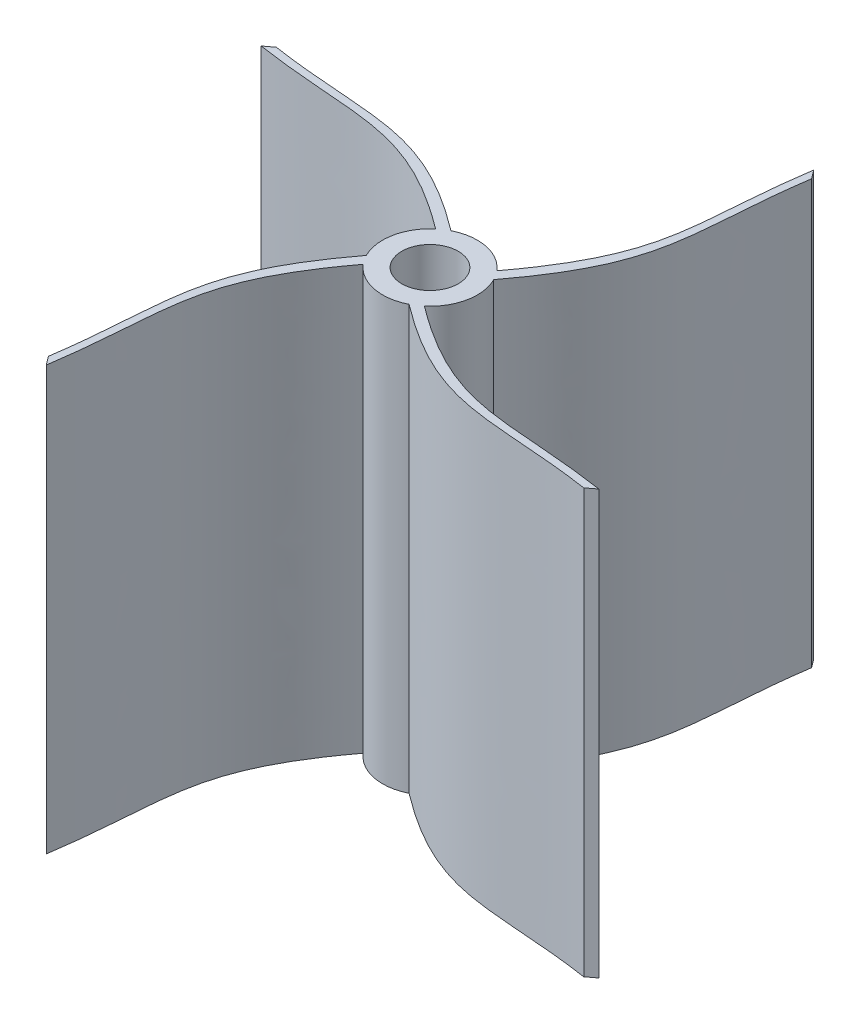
ISO-10303-21;
HEADER;
FILE_DESCRIPTION(('STEP AP214'),'2;1');
FILE_NAME('part.step','',(''),(''),'','','');
FILE_SCHEMA(('AUTOMOTIVE_DESIGN { 1 0 10303 214 1 1 1 1 }'));
ENDSEC;
DATA;
#1=APPLICATION_CONTEXT('core data for automotive mechanical design processes');
#2=APPLICATION_PROTOCOL_DEFINITION('international standard','automotive_design',2000,#1);
#3=PRODUCT_CONTEXT('',#1,'mechanical');
#4=PRODUCT('Part','Part','',(#3));
#5=PRODUCT_RELATED_PRODUCT_CATEGORY('part','',(#4));
#6=PRODUCT_DEFINITION_FORMATION('','',#4);
#7=PRODUCT_DEFINITION_CONTEXT('part definition',#1,'design');
#8=PRODUCT_DEFINITION('design','',#6,#7);
#9=PRODUCT_DEFINITION_SHAPE('','',#8);
#10=(LENGTH_UNIT() NAMED_UNIT(*) SI_UNIT(.MILLI.,.METRE.));
#11=(NAMED_UNIT(*) PLANE_ANGLE_UNIT() SI_UNIT($,.RADIAN.));
#12=(NAMED_UNIT(*) SI_UNIT($,.STERADIAN.) SOLID_ANGLE_UNIT());
#13=UNCERTAINTY_MEASURE_WITH_UNIT(LENGTH_MEASURE(1.E-05),#10,'distance_accuracy_value','');
#14=(GEOMETRIC_REPRESENTATION_CONTEXT(3) GLOBAL_UNCERTAINTY_ASSIGNED_CONTEXT((#13)) GLOBAL_UNIT_ASSIGNED_CONTEXT((#10,
#11,#12)) REPRESENTATION_CONTEXT('',''));
#15=CARTESIAN_POINT('',(0.,0.,0.));
#16=DIRECTION('',(0.,0.,1.));
#17=DIRECTION('',(1.,0.,0.));
#18=AXIS2_PLACEMENT_3D('',#15,#16,#17);
#19=CARTESIAN_POINT('',(-174.026951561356,300.,-50.4298145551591));
#20=CARTESIAN_POINT('',(-97.2351471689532,300.,-38.7856041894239));
#21=CARTESIAN_POINT('',(-71.1604524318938,300.,-53.3874332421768));
#22=CARTESIAN_POINT('',(0.,300.,0.));
#23=B_SPLINE_CURVE_WITH_KNOTS('',3,(#19,#20,#21,#22),.UNSPECIFIED.,.F.,.F.,(4,4),(0.,1.),.UNSPECIFIED.);
#24=DIRECTION('',(0.,-1.,0.));
#25=VECTOR('',#24,1.);
#26=SURFACE_OF_LINEAR_EXTRUSION('',#23,#25);
#27=CARTESIAN_POINT('',(-174.026951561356,0.,-50.4298145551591));
#28=CARTESIAN_POINT('',(-97.2351471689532,0.,-38.7856041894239));
#29=CARTESIAN_POINT('',(-71.1604524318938,0.,-53.3874332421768));
#30=CARTESIAN_POINT('',(0.,0.,0.));
#31=B_SPLINE_CURVE_WITH_KNOTS('',3,(#27,#28,#29,#30),.UNSPECIFIED.,.F.,.F.,(4,4),(0.,1.),.UNSPECIFIED.);
#32=CARTESIAN_POINT('',(-174.026951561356,0.,-50.4298145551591));
#33=VERTEX_POINT('',#32);
#34=CARTESIAN_POINT('',(0.,0.,0.));
#35=VERTEX_POINT('',#34);
#36=EDGE_CURVE('E301',#33,#35,#31,.T.);
#37=ORIENTED_EDGE('',*,*,#36,.T.);
#38=DIRECTION('',(0.,-1.,0.));
#39=VECTOR('',#38,1.);
#40=CARTESIAN_POINT('',(0.,300.,0.));
#41=LINE('',#40,#39);
#42=CARTESIAN_POINT('',(0.,300.,0.));
#43=VERTEX_POINT('',#42);
#44=EDGE_CURVE('E11',#43,#35,#41,.T.);
#45=ORIENTED_EDGE('',*,*,#44,.F.);
#46=CARTESIAN_POINT('',(-174.026951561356,300.,-50.4298145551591));
#47=VERTEX_POINT('',#46);
#48=EDGE_CURVE('E369',#47,#43,#23,.T.);
#49=ORIENTED_EDGE('',*,*,#48,.F.);
#50=DIRECTION('',(0.,-1.,0.));
#51=VECTOR('',#50,1.);
#52=CARTESIAN_POINT('',(-174.026951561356,300.,-50.4298145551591));
#53=LINE('',#52,#51);
#54=EDGE_CURVE('E174',#47,#33,#53,.T.);
#55=ORIENTED_EDGE('',*,*,#54,.T.);
#56=EDGE_LOOP('',(#37,#45,#49,#55));
#57=FACE_BOUND('',#56,.T.);
#58=ADVANCED_FACE('F33',(#57),#26,.F.);
#59=CARTESIAN_POINT('',(21.7032315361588,300.,25.6602335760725));
#60=DIRECTION('',(0.,-1.,0.));
#61=DIRECTION('',(0.,0.,-1.));
#62=AXIS2_PLACEMENT_3D('',#59,#60,#61);
#63=CYLINDRICAL_SURFACE('',#62,33.6077051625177);
#64=CARTESIAN_POINT('',(21.7032315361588,0.,25.6602335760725));
#65=DIRECTION('',(0.,1.,0.));
#66=DIRECTION('',(0.,0.,1.));
#67=AXIS2_PLACEMENT_3D('',#64,#65,#66);
#68=CIRCLE('',#67,33.6077051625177);
#69=CARTESIAN_POINT('',(-8.29676846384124,0.,40.808759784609));
#70=VERTEX_POINT('',#69);
#71=EDGE_CURVE('E292',#35,#70,#68,.T.);
#72=ORIENTED_EDGE('',*,*,#71,.T.);
#73=DIRECTION('',(0.,-1.,0.));
#74=VECTOR('',#73,1.);
#75=CARTESIAN_POINT('',(-8.29676846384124,300.,40.808759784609));
#76=LINE('',#75,#74);
#77=CARTESIAN_POINT('',(-8.29676846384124,300.,40.808759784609));
#78=VERTEX_POINT('',#77);
#79=EDGE_CURVE('E42',#78,#70,#76,.T.);
#80=ORIENTED_EDGE('',*,*,#79,.F.);
#81=CARTESIAN_POINT('',(21.7032315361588,300.,25.6602335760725));
#82=DIRECTION('',(0.,1.,0.));
#83=DIRECTION('',(0.,0.,1.));
#84=AXIS2_PLACEMENT_3D('',#81,#82,#83);
#85=CIRCLE('',#84,33.6077051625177);
#86=EDGE_CURVE('E117',#43,#78,#85,.T.);
#87=ORIENTED_EDGE('',*,*,#86,.F.);
#88=ORIENTED_EDGE('',*,*,#44,.T.);
#89=EDGE_LOOP('',(#72,#80,#87,#88));
#90=FACE_BOUND('',#89,.T.);
#91=ADVANCED_FACE('F285',(#90),#63,.T.);
#92=CARTESIAN_POINT('',(-8.29676846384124,300.,40.808759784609));
#93=CARTESIAN_POINT('',(-62.1358647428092,300.,112.049101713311));
#94=CARTESIAN_POINT('',(-47.5340356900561,300.,138.123796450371));
#95=CARTESIAN_POINT('',(-59.0069013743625,300.,215.304892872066));
#96=B_SPLINE_CURVE_WITH_KNOTS('',3,(#92,#93,#94,#95),.UNSPECIFIED.,.F.,.F.,(4,4),(0.,1.),.UNSPECIFIED.);
#97=DIRECTION('',(0.,-1.,0.));
#98=VECTOR('',#97,1.);
#99=SURFACE_OF_LINEAR_EXTRUSION('',#96,#98);
#100=CARTESIAN_POINT('',(-8.29676846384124,0.,40.808759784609));
#101=CARTESIAN_POINT('',(-62.1358647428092,0.,112.049101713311));
#102=CARTESIAN_POINT('',(-47.5340356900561,0.,138.123796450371));
#103=CARTESIAN_POINT('',(-59.0069013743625,0.,215.304892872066));
#104=B_SPLINE_CURVE_WITH_KNOTS('',3,(#100,#101,#102,#103),.UNSPECIFIED.,.F.,.F.,(4,4),(0.,1.),.UNSPECIFIED.);
#105=CARTESIAN_POINT('',(-59.0069013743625,0.,215.304892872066));
#106=VERTEX_POINT('',#105);
#107=EDGE_CURVE('E300',#70,#106,#104,.T.);
#108=ORIENTED_EDGE('',*,*,#107,.T.);
#109=DIRECTION('',(0.,-1.,0.));
#110=VECTOR('',#109,1.);
#111=CARTESIAN_POINT('',(-59.0069013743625,300.,215.304892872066));
#112=LINE('',#111,#110);
#113=CARTESIAN_POINT('',(-59.0069013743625,300.,215.304892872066));
#114=VERTEX_POINT('',#113);
#115=EDGE_CURVE('E305',#114,#106,#112,.T.);
#116=ORIENTED_EDGE('',*,*,#115,.F.);
#117=EDGE_CURVE('E275',#78,#114,#96,.T.);
#118=ORIENTED_EDGE('',*,*,#117,.F.);
#119=ORIENTED_EDGE('',*,*,#79,.T.);
#120=EDGE_LOOP('',(#108,#116,#118,#119));
#121=FACE_BOUND('',#120,.T.);
#122=ADVANCED_FACE('F283',(#121),#99,.F.);
#123=CARTESIAN_POINT('',(-59.0069013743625,300.,215.304892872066));
#124=DIRECTION('',(0.796471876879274,0.,-0.604675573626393));
#125=DIRECTION('',(-0.604675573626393,0.,-0.796471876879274));
#126=AXIS2_PLACEMENT_3D('',#123,#124,#125);
#127=PLANE('',#126);
#128=DIRECTION('',(0.604675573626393,0.,0.796471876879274));
#129=VECTOR('',#128,1.);
#130=CARTESIAN_POINT('',(-59.0069013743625,0.,215.304892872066));
#131=LINE('',#130,#129);
#132=CARTESIAN_POINT('',(-54.3868165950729,0.,221.390416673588));
#133=VERTEX_POINT('',#132);
#134=EDGE_CURVE('E309',#106,#133,#131,.T.);
#135=ORIENTED_EDGE('',*,*,#134,.T.);
#136=DIRECTION('',(0.,-1.,0.));
#137=VECTOR('',#136,1.);
#138=CARTESIAN_POINT('',(-54.3868165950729,300.,221.390416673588));
#139=LINE('',#138,#137);
#140=CARTESIAN_POINT('',(-54.3868165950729,300.,221.390416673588));
#141=VERTEX_POINT('',#140);
#142=EDGE_CURVE('E397',#141,#133,#139,.T.);
#143=ORIENTED_EDGE('',*,*,#142,.F.);
#144=DIRECTION('',(0.604675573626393,0.,0.796471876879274));
#145=VECTOR('',#144,1.);
#146=CARTESIAN_POINT('',(-59.0069013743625,300.,215.304892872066));
#147=LINE('',#146,#145);
#148=EDGE_CURVE('E270',#114,#141,#147,.T.);
#149=ORIENTED_EDGE('',*,*,#148,.F.);
#150=ORIENTED_EDGE('',*,*,#115,.T.);
#151=EDGE_LOOP('',(#135,#143,#149,#150));
#152=FACE_BOUND('',#151,.T.);
#153=ADVANCED_FACE('F262',(#152),#127,.F.);
#154=CARTESIAN_POINT('',(-54.3868165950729,300.,221.390416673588));
#155=CARTESIAN_POINT('',(-42.7426062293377,300.,144.598612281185));
#156=CARTESIAN_POINT('',(-57.3444352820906,300.,118.523917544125));
#157=CARTESIAN_POINT('',(-3.95700203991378,300.,47.3634651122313));
#158=B_SPLINE_CURVE_WITH_KNOTS('',3,(#154,#155,#156,#157),.UNSPECIFIED.,.F.,.F.,(4,4),(0.,1.),.UNSPECIFIED.);
#159=DIRECTION('',(0.,-1.,0.));
#160=VECTOR('',#159,1.);
#161=SURFACE_OF_LINEAR_EXTRUSION('',#158,#160);
#162=CARTESIAN_POINT('',(-54.3868165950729,0.,221.390416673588));
#163=CARTESIAN_POINT('',(-42.7426062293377,0.,144.598612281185));
#164=CARTESIAN_POINT('',(-57.3444352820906,0.,118.523917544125));
#165=CARTESIAN_POINT('',(-3.95700203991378,0.,47.3634651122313));
#166=B_SPLINE_CURVE_WITH_KNOTS('',3,(#162,#163,#164,#165),.UNSPECIFIED.,.F.,.F.,(4,4),(0.,1.),.UNSPECIFIED.);
#167=CARTESIAN_POINT('',(-3.95700203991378,0.,47.3634651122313));
#168=VERTEX_POINT('',#167);
#169=EDGE_CURVE('E311',#133,#168,#166,.T.);
#170=ORIENTED_EDGE('',*,*,#169,.T.);
#171=DIRECTION('',(0.,-1.,0.));
#172=VECTOR('',#171,1.);
#173=CARTESIAN_POINT('',(-3.95700203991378,300.,47.3634651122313));
#174=LINE('',#173,#172);
#175=CARTESIAN_POINT('',(-3.95700203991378,300.,47.3634651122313));
#176=VERTEX_POINT('',#175);
#177=EDGE_CURVE('E394',#176,#168,#174,.T.);
#178=ORIENTED_EDGE('',*,*,#177,.F.);
#179=EDGE_CURVE('E265',#141,#176,#158,.T.);
#180=ORIENTED_EDGE('',*,*,#179,.F.);
#181=ORIENTED_EDGE('',*,*,#142,.T.);
#182=EDGE_LOOP('',(#170,#178,#180,#181));
#183=FACE_BOUND('',#182,.T.);
#184=ADVANCED_FACE('F258',(#183),#161,.F.);
#185=CARTESIAN_POINT('',(21.7032315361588,300.,25.6602335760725));
#186=DIRECTION('',(0.,-1.,0.));
#187=DIRECTION('',(0.,0.,-1.));
#188=AXIS2_PLACEMENT_3D('',#185,#186,#187);
#189=CYLINDRICAL_SURFACE('',#188,33.6077051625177);
#190=CARTESIAN_POINT('',(21.7032315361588,0.,25.6602335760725));
#191=DIRECTION('',(0.,1.,0.));
#192=DIRECTION('',(0.,0.,1.));
#193=AXIS2_PLACEMENT_3D('',#190,#191,#192);
#194=CIRCLE('',#193,33.6077051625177);
#195=CARTESIAN_POINT('',(36.8517577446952,0.,55.6602335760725));
#196=VERTEX_POINT('',#195);
#197=EDGE_CURVE('E322',#168,#196,#194,.T.);
#198=ORIENTED_EDGE('',*,*,#197,.T.);
#199=DIRECTION('',(0.,-1.,0.));
#200=VECTOR('',#199,1.);
#201=CARTESIAN_POINT('',(36.8517577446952,300.,55.6602335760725));
#202=LINE('',#201,#200);
#203=CARTESIAN_POINT('',(36.8517577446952,300.,55.6602335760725));
#204=VERTEX_POINT('',#203);
#205=EDGE_CURVE('E391',#204,#196,#202,.T.);
#206=ORIENTED_EDGE('',*,*,#205,.F.);
#207=CARTESIAN_POINT('',(21.7032315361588,300.,25.6602335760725));
#208=DIRECTION('',(0.,1.,0.));
#209=DIRECTION('',(0.,0.,1.));
#210=AXIS2_PLACEMENT_3D('',#207,#208,#209);
#211=CIRCLE('',#210,33.6077051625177);
#212=EDGE_CURVE('E246',#176,#204,#211,.T.);
#213=ORIENTED_EDGE('',*,*,#212,.F.);
#214=ORIENTED_EDGE('',*,*,#177,.T.);
#215=EDGE_LOOP('',(#198,#206,#213,#214));
#216=FACE_BOUND('',#215,.T.);
#217=ADVANCED_FACE('F254',(#216),#189,.T.);
#218=CARTESIAN_POINT('',(36.8517577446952,300.,55.6602335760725));
#219=CARTESIAN_POINT('',(108.092099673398,300.,109.499329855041));
#220=CARTESIAN_POINT('',(134.166794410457,300.,94.8975008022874));
#221=CARTESIAN_POINT('',(211.347890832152,300.,106.370366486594));
#222=B_SPLINE_CURVE_WITH_KNOTS('',3,(#218,#219,#220,#221),.UNSPECIFIED.,.F.,.F.,(4,4),(0.,1.),.UNSPECIFIED.);
#223=DIRECTION('',(0.,-1.,0.));
#224=VECTOR('',#223,1.);
#225=SURFACE_OF_LINEAR_EXTRUSION('',#222,#224);
#226=CARTESIAN_POINT('',(36.8517577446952,0.,55.6602335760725));
#227=CARTESIAN_POINT('',(108.092099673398,0.,109.499329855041));
#228=CARTESIAN_POINT('',(134.166794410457,0.,94.8975008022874));
#229=CARTESIAN_POINT('',(211.347890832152,0.,106.370366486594));
#230=B_SPLINE_CURVE_WITH_KNOTS('',3,(#226,#227,#228,#229),.UNSPECIFIED.,.F.,.F.,(4,4),(0.,1.),.UNSPECIFIED.);
#231=CARTESIAN_POINT('',(211.347890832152,0.,106.370366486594));
#232=VERTEX_POINT('',#231);
#233=EDGE_CURVE('E327',#196,#232,#230,.T.);
#234=ORIENTED_EDGE('',*,*,#233,.T.);
#235=DIRECTION('',(0.,-1.,0.));
#236=VECTOR('',#235,1.);
#237=CARTESIAN_POINT('',(211.347890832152,300.,106.370366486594));
#238=LINE('',#237,#236);
#239=CARTESIAN_POINT('',(211.347890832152,300.,106.370366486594));
#240=VERTEX_POINT('',#239);
#241=EDGE_CURVE('E388',#240,#232,#238,.T.);
#242=ORIENTED_EDGE('',*,*,#241,.F.);
#243=EDGE_CURVE('E241',#204,#240,#222,.T.);
#244=ORIENTED_EDGE('',*,*,#243,.F.);
#245=ORIENTED_EDGE('',*,*,#205,.T.);
#246=EDGE_LOOP('',(#234,#242,#244,#245));
#247=FACE_BOUND('',#246,.T.);
#248=ADVANCED_FACE('F251',(#247),#225,.F.);
#249=CARTESIAN_POINT('',(211.347890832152,300.,106.370366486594));
#250=DIRECTION('',(-0.604675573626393,0.,-0.796471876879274));
#251=DIRECTION('',(-0.796471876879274,0.,0.604675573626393));
#252=AXIS2_PLACEMENT_3D('',#249,#250,#251);
#253=PLANE('',#252);
#254=DIRECTION('',(0.796471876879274,0.,-0.604675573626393));
#255=VECTOR('',#254,1.);
#256=CARTESIAN_POINT('',(211.347890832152,0.,106.370366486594));
#257=LINE('',#256,#255);
#258=CARTESIAN_POINT('',(217.433414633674,0.,101.750281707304));
#259=VERTEX_POINT('',#258);
#260=EDGE_CURVE('E331',#232,#259,#257,.T.);
#261=ORIENTED_EDGE('',*,*,#260,.T.);
#262=DIRECTION('',(0.,-1.,0.));
#263=VECTOR('',#262,1.);
#264=CARTESIAN_POINT('',(217.433414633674,300.,101.750281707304));
#265=LINE('',#264,#263);
#266=CARTESIAN_POINT('',(217.433414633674,300.,101.750281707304));
#267=VERTEX_POINT('',#266);
#268=EDGE_CURVE('E385',#267,#259,#265,.T.);
#269=ORIENTED_EDGE('',*,*,#268,.F.);
#270=DIRECTION('',(0.796471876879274,0.,-0.604675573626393));
#271=VECTOR('',#270,1.);
#272=CARTESIAN_POINT('',(211.347890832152,300.,106.370366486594));
#273=LINE('',#272,#271);
#274=EDGE_CURVE('E236',#240,#267,#273,.T.);
#275=ORIENTED_EDGE('',*,*,#274,.F.);
#276=ORIENTED_EDGE('',*,*,#241,.T.);
#277=EDGE_LOOP('',(#261,#269,#275,#276));
#278=FACE_BOUND('',#277,.T.);
#279=ADVANCED_FACE('F228',(#278),#253,.F.);
#280=CARTESIAN_POINT('',(217.433414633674,300.,101.750281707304));
#281=CARTESIAN_POINT('',(140.641610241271,300.,90.1060713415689));
#282=CARTESIAN_POINT('',(114.566915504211,300.,104.707900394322));
#283=CARTESIAN_POINT('',(43.4064630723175,300.,51.3204671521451));
#284=B_SPLINE_CURVE_WITH_KNOTS('',3,(#280,#281,#282,#283),.UNSPECIFIED.,.F.,.F.,(4,4),(0.,1.),.UNSPECIFIED.);
#285=DIRECTION('',(0.,-1.,0.));
#286=VECTOR('',#285,1.);
#287=SURFACE_OF_LINEAR_EXTRUSION('',#284,#286);
#288=CARTESIAN_POINT('',(217.433414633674,0.,101.750281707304));
#289=CARTESIAN_POINT('',(140.641610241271,0.,90.1060713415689));
#290=CARTESIAN_POINT('',(114.566915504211,0.,104.707900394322));
#291=CARTESIAN_POINT('',(43.4064630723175,0.,51.3204671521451));
#292=B_SPLINE_CURVE_WITH_KNOTS('',3,(#288,#289,#290,#291),.UNSPECIFIED.,.F.,.F.,(4,4),(0.,1.),.UNSPECIFIED.);
#293=CARTESIAN_POINT('',(43.4064630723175,0.,51.3204671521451));
#294=VERTEX_POINT('',#293);
#295=EDGE_CURVE('E336',#259,#294,#292,.T.);
#296=ORIENTED_EDGE('',*,*,#295,.T.);
#297=DIRECTION('',(0.,-1.,0.));
#298=VECTOR('',#297,1.);
#299=CARTESIAN_POINT('',(43.4064630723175,300.,51.3204671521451));
#300=LINE('',#299,#298);
#301=CARTESIAN_POINT('',(43.4064630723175,300.,51.3204671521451));
#302=VERTEX_POINT('',#301);
#303=EDGE_CURVE('E382',#302,#294,#300,.T.);
#304=ORIENTED_EDGE('',*,*,#303,.F.);
#305=EDGE_CURVE('E231',#267,#302,#284,.T.);
#306=ORIENTED_EDGE('',*,*,#305,.F.);
#307=ORIENTED_EDGE('',*,*,#268,.T.);
#308=EDGE_LOOP('',(#296,#304,#306,#307));
#309=FACE_BOUND('',#308,.T.);
#310=ADVANCED_FACE('F224',(#309),#287,.F.);
#311=CARTESIAN_POINT('',(21.7032315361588,300.,25.6602335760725));
#312=DIRECTION('',(0.,-1.,0.));
#313=DIRECTION('',(0.,0.,-1.));
#314=AXIS2_PLACEMENT_3D('',#311,#312,#313);
#315=CYLINDRICAL_SURFACE('',#314,33.6077051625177);
#316=CARTESIAN_POINT('',(21.7032315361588,0.,25.6602335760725));
#317=DIRECTION('',(0.,1.,0.));
#318=DIRECTION('',(0.,0.,1.));
#319=AXIS2_PLACEMENT_3D('',#316,#317,#318);
#320=CIRCLE('',#319,33.6077051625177);
#321=CARTESIAN_POINT('',(51.7032315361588,0.,10.5117073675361));
#322=VERTEX_POINT('',#321);
#323=EDGE_CURVE('E340',#294,#322,#320,.T.);
#324=ORIENTED_EDGE('',*,*,#323,.T.);
#325=DIRECTION('',(0.,-1.,0.));
#326=VECTOR('',#325,1.);
#327=CARTESIAN_POINT('',(51.7032315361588,300.,10.5117073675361));
#328=LINE('',#327,#326);
#329=CARTESIAN_POINT('',(51.7032315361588,300.,10.5117073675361));
#330=VERTEX_POINT('',#329);
#331=EDGE_CURVE('E379',#330,#322,#328,.T.);
#332=ORIENTED_EDGE('',*,*,#331,.F.);
#333=CARTESIAN_POINT('',(21.7032315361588,300.,25.6602335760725));
#334=DIRECTION('',(0.,1.,0.));
#335=DIRECTION('',(0.,0.,1.));
#336=AXIS2_PLACEMENT_3D('',#333,#334,#335);
#337=CIRCLE('',#336,33.6077051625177);
#338=EDGE_CURVE('E212',#302,#330,#337,.T.);
#339=ORIENTED_EDGE('',*,*,#338,.F.);
#340=ORIENTED_EDGE('',*,*,#303,.T.);
#341=EDGE_LOOP('',(#324,#332,#339,#340));
#342=FACE_BOUND('',#341,.T.);
#343=ADVANCED_FACE('F220',(#342),#315,.T.);
#344=CARTESIAN_POINT('',(51.7032315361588,300.,10.5117073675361));
#345=CARTESIAN_POINT('',(105.542327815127,300.,-60.7286345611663));
#346=CARTESIAN_POINT('',(90.9404987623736,300.,-86.8033292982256));
#347=CARTESIAN_POINT('',(102.41336444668,300.,-163.984425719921));
#348=B_SPLINE_CURVE_WITH_KNOTS('',3,(#344,#345,#346,#347),.UNSPECIFIED.,.F.,.F.,(4,4),(0.,1.),.UNSPECIFIED.);
#349=DIRECTION('',(0.,-1.,0.));
#350=VECTOR('',#349,1.);
#351=SURFACE_OF_LINEAR_EXTRUSION('',#348,#350);
#352=CARTESIAN_POINT('',(51.7032315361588,0.,10.5117073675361));
#353=CARTESIAN_POINT('',(105.542327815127,0.,-60.7286345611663));
#354=CARTESIAN_POINT('',(90.9404987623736,0.,-86.8033292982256));
#355=CARTESIAN_POINT('',(102.41336444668,0.,-163.984425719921));
#356=B_SPLINE_CURVE_WITH_KNOTS('',3,(#352,#353,#354,#355),.UNSPECIFIED.,.F.,.F.,(4,4),(0.,1.),.UNSPECIFIED.);
#357=CARTESIAN_POINT('',(102.41336444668,0.,-163.984425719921));
#358=VERTEX_POINT('',#357);
#359=EDGE_CURVE('E345',#322,#358,#356,.T.);
#360=ORIENTED_EDGE('',*,*,#359,.T.);
#361=DIRECTION('',(0.,-1.,0.));
#362=VECTOR('',#361,1.);
#363=CARTESIAN_POINT('',(102.41336444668,300.,-163.984425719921));
#364=LINE('',#363,#362);
#365=CARTESIAN_POINT('',(102.41336444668,300.,-163.984425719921));
#366=VERTEX_POINT('',#365);
#367=EDGE_CURVE('E376',#366,#358,#364,.T.);
#368=ORIENTED_EDGE('',*,*,#367,.F.);
#369=EDGE_CURVE('E207',#330,#366,#348,.T.);
#370=ORIENTED_EDGE('',*,*,#369,.F.);
#371=ORIENTED_EDGE('',*,*,#331,.T.);
#372=EDGE_LOOP('',(#360,#368,#370,#371));
#373=FACE_BOUND('',#372,.T.);
#374=ADVANCED_FACE('F217',(#373),#351,.F.);
#375=CARTESIAN_POINT('',(102.41336444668,300.,-163.984425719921));
#376=DIRECTION('',(-0.796471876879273,0.,0.604675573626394));
#377=DIRECTION('',(0.604675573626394,0.,0.796471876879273));
#378=AXIS2_PLACEMENT_3D('',#375,#376,#377);
#379=PLANE('',#378);
#380=DIRECTION('',(-0.604675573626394,0.,-0.796471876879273));
#381=VECTOR('',#380,1.);
#382=CARTESIAN_POINT('',(102.41336444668,0.,-163.984425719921));
#383=LINE('',#382,#381);
#384=CARTESIAN_POINT('',(97.7932796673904,0.,-170.069949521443));
#385=VERTEX_POINT('',#384);
#386=EDGE_CURVE('E349',#358,#385,#383,.T.);
#387=ORIENTED_EDGE('',*,*,#386,.T.);
#388=DIRECTION('',(0.,-1.,0.));
#389=VECTOR('',#388,1.);
#390=CARTESIAN_POINT('',(97.7932796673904,300.,-170.069949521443));
#391=LINE('',#390,#389);
#392=CARTESIAN_POINT('',(97.7932796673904,300.,-170.069949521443));
#393=VERTEX_POINT('',#392);
#394=EDGE_CURVE('E373',#393,#385,#391,.T.);
#395=ORIENTED_EDGE('',*,*,#394,.F.);
#396=DIRECTION('',(-0.604675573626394,0.,-0.796471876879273));
#397=VECTOR('',#396,1.);
#398=CARTESIAN_POINT('',(102.41336444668,300.,-163.984425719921));
#399=LINE('',#398,#397);
#400=EDGE_CURVE('E202',#366,#393,#399,.T.);
#401=ORIENTED_EDGE('',*,*,#400,.F.);
#402=ORIENTED_EDGE('',*,*,#367,.T.);
#403=EDGE_LOOP('',(#387,#395,#401,#402));
#404=FACE_BOUND('',#403,.T.);
#405=ADVANCED_FACE('F195',(#404),#379,.F.);
#406=CARTESIAN_POINT('',(97.7932796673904,300.,-170.069949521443));
#407=CARTESIAN_POINT('',(86.1490693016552,300.,-93.2781451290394));
#408=CARTESIAN_POINT('',(100.750898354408,300.,-67.20345039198));
#409=CARTESIAN_POINT('',(47.3634651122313,300.,3.95700203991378));
#410=B_SPLINE_CURVE_WITH_KNOTS('',3,(#406,#407,#408,#409),.UNSPECIFIED.,.F.,.F.,(4,4),(0.,1.),.UNSPECIFIED.);
#411=DIRECTION('',(0.,-1.,0.));
#412=VECTOR('',#411,1.);
#413=SURFACE_OF_LINEAR_EXTRUSION('',#410,#412);
#414=CARTESIAN_POINT('',(97.7932796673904,0.,-170.069949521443));
#415=CARTESIAN_POINT('',(86.1490693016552,0.,-93.2781451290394));
#416=CARTESIAN_POINT('',(100.750898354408,0.,-67.20345039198));
#417=CARTESIAN_POINT('',(47.3634651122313,0.,3.95700203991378));
#418=B_SPLINE_CURVE_WITH_KNOTS('',3,(#414,#415,#416,#417),.UNSPECIFIED.,.F.,.F.,(4,4),(0.,1.),.UNSPECIFIED.);
#419=CARTESIAN_POINT('',(47.3634651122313,0.,3.95700203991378));
#420=VERTEX_POINT('',#419);
#421=EDGE_CURVE('E354',#385,#420,#418,.T.);
#422=ORIENTED_EDGE('',*,*,#421,.T.);
#423=DIRECTION('',(0.,-1.,0.));
#424=VECTOR('',#423,1.);
#425=CARTESIAN_POINT('',(47.3634651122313,300.,3.95700203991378));
#426=LINE('',#425,#424);
#427=CARTESIAN_POINT('',(47.3634651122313,300.,3.95700203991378));
#428=VERTEX_POINT('',#427);
#429=EDGE_CURVE('E169',#428,#420,#426,.T.);
#430=ORIENTED_EDGE('',*,*,#429,.F.);
#431=EDGE_CURVE('E160',#393,#428,#410,.T.);
#432=ORIENTED_EDGE('',*,*,#431,.F.);
#433=ORIENTED_EDGE('',*,*,#394,.T.);
#434=EDGE_LOOP('',(#422,#430,#432,#433));
#435=FACE_BOUND('',#434,.T.);
#436=ADVANCED_FACE('F192',(#435),#413,.F.);
#437=CARTESIAN_POINT('',(21.7032315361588,300.,25.6602335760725));
#438=DIRECTION('',(0.,-1.,0.));
#439=DIRECTION('',(0.,0.,-1.));
#440=AXIS2_PLACEMENT_3D('',#437,#438,#439);
#441=CYLINDRICAL_SURFACE('',#440,33.6077051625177);
#442=CARTESIAN_POINT('',(21.7032315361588,0.,25.6602335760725));
#443=DIRECTION('',(0.,1.,0.));
#444=DIRECTION('',(0.,0.,1.));
#445=AXIS2_PLACEMENT_3D('',#442,#443,#444);
#446=CIRCLE('',#445,33.6077051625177);
#447=CARTESIAN_POINT('',(6.55470532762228,0.,-4.33976642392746));
#448=VERTEX_POINT('',#447);
#449=EDGE_CURVE('E168',#420,#448,#446,.T.);
#450=ORIENTED_EDGE('',*,*,#449,.T.);
#451=DIRECTION('',(0.,-1.,0.));
#452=VECTOR('',#451,1.);
#453=CARTESIAN_POINT('',(6.55470532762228,300.,-4.33976642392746));
#454=LINE('',#453,#452);
#455=CARTESIAN_POINT('',(6.55470532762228,300.,-4.33976642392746));
#456=VERTEX_POINT('',#455);
#457=EDGE_CURVE('E165',#456,#448,#454,.T.);
#458=ORIENTED_EDGE('',*,*,#457,.F.);
#459=CARTESIAN_POINT('',(21.7032315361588,300.,25.6602335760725));
#460=DIRECTION('',(0.,1.,0.));
#461=DIRECTION('',(0.,0.,1.));
#462=AXIS2_PLACEMENT_3D('',#459,#460,#461);
#463=CIRCLE('',#462,33.6077051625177);
#464=EDGE_CURVE('E154',#428,#456,#463,.T.);
#465=ORIENTED_EDGE('',*,*,#464,.F.);
#466=ORIENTED_EDGE('',*,*,#429,.T.);
#467=EDGE_LOOP('',(#450,#458,#465,#466));
#468=FACE_BOUND('',#467,.T.);
#469=ADVANCED_FACE('F166',(#468),#441,.T.);
#470=CARTESIAN_POINT('',(6.55470532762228,300.,-4.33976642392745));
#471=CARTESIAN_POINT('',(-64.68563660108,300.,-58.1788627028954));
#472=CARTESIAN_POINT('',(-90.7603313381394,300.,-43.5770336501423));
#473=CARTESIAN_POINT('',(-167.941427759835,300.,-55.0498993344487));
#474=B_SPLINE_CURVE_WITH_KNOTS('',3,(#470,#471,#472,#473),.UNSPECIFIED.,.F.,.F.,(4,4),(0.,1.),.UNSPECIFIED.);
#475=DIRECTION('',(0.,-1.,0.));
#476=VECTOR('',#475,1.);
#477=SURFACE_OF_LINEAR_EXTRUSION('',#474,#476);
#478=CARTESIAN_POINT('',(6.55470532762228,0.,-4.33976642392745));
#479=CARTESIAN_POINT('',(-64.68563660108,0.,-58.1788627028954));
#480=CARTESIAN_POINT('',(-90.7603313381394,0.,-43.5770336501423));
#481=CARTESIAN_POINT('',(-167.941427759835,0.,-55.0498993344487));
#482=B_SPLINE_CURVE_WITH_KNOTS('',3,(#478,#479,#480,#481),.UNSPECIFIED.,.F.,.F.,(4,4),(0.,1.),.UNSPECIFIED.);
#483=CARTESIAN_POINT('',(-167.941427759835,0.,-55.0498993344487));
#484=VERTEX_POINT('',#483);
#485=EDGE_CURVE('E103',#448,#484,#482,.T.);
#486=ORIENTED_EDGE('',*,*,#485,.T.);
#487=DIRECTION('',(0.,-1.,0.));
#488=VECTOR('',#487,1.);
#489=CARTESIAN_POINT('',(-167.941427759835,300.,-55.0498993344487));
#490=LINE('',#489,#488);
#491=CARTESIAN_POINT('',(-167.941427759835,300.,-55.0498993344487));
#492=VERTEX_POINT('',#491);
#493=EDGE_CURVE('E170',#492,#484,#490,.T.);
#494=ORIENTED_EDGE('',*,*,#493,.F.);
#495=EDGE_CURVE('E158',#456,#492,#474,.T.);
#496=ORIENTED_EDGE('',*,*,#495,.F.);
#497=ORIENTED_EDGE('',*,*,#457,.T.);
#498=EDGE_LOOP('',(#486,#494,#496,#497));
#499=FACE_BOUND('',#498,.T.);
#500=ADVANCED_FACE('F172',(#499),#477,.F.);
#501=CARTESIAN_POINT('',(-167.941427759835,300.,-55.0498993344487));
#502=DIRECTION('',(0.604675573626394,0.,0.796471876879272));
#503=DIRECTION('',(0.796471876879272,0.,-0.604675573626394));
#504=AXIS2_PLACEMENT_3D('',#501,#502,#503);
#505=PLANE('',#504);
#506=DIRECTION('',(-0.796471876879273,0.,0.604675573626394));
#507=VECTOR('',#506,1.);
#508=CARTESIAN_POINT('',(-167.941427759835,0.,-55.0498993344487));
#509=LINE('',#508,#507);
#510=EDGE_CURVE('E109',#484,#33,#509,.T.);
#511=ORIENTED_EDGE('',*,*,#510,.T.);
#512=ORIENTED_EDGE('',*,*,#54,.F.);
#513=DIRECTION('',(-0.796471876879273,0.,0.604675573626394));
#514=VECTOR('',#513,1.);
#515=CARTESIAN_POINT('',(-167.941427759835,300.,-55.0498993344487));
#516=LINE('',#515,#514);
#517=EDGE_CURVE('E50',#492,#47,#516,.T.);
#518=ORIENTED_EDGE('',*,*,#517,.F.);
#519=ORIENTED_EDGE('',*,*,#493,.T.);
#520=EDGE_LOOP('',(#511,#512,#518,#519));
#521=FACE_BOUND('',#520,.T.);
#522=ADVANCED_FACE('F188',(#521),#505,.F.);
#523=CARTESIAN_POINT('',(-84.9017187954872,300.,-40.8686158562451));
#524=DIRECTION('',(0.,-1.,0.));
#525=DIRECTION('',(0.,0.,-1.));
#526=AXIS2_PLACEMENT_3D('',#523,#524,#525);
#527=PLANE('',#526);
#528=CARTESIAN_POINT('',(21.7032315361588,300.,25.6602335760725));
#529=DIRECTION('',(0.,1.,0.));
#530=DIRECTION('',(0.,0.,1.));
#531=AXIS2_PLACEMENT_3D('',#528,#529,#530);
#532=CIRCLE('',#531,20.);
#533=CARTESIAN_POINT('',(21.7032315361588,300.,45.6602335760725));
#534=VERTEX_POINT('',#533);
#535=EDGE_CURVE('E410',#534,#534,#532,.T.);
#536=ORIENTED_EDGE('',*,*,#535,.F.);
#537=EDGE_LOOP('',(#536));
#538=FACE_BOUND('',#537,.T.);
#539=ORIENTED_EDGE('',*,*,#48,.T.);
#540=ORIENTED_EDGE('',*,*,#86,.T.);
#541=ORIENTED_EDGE('',*,*,#117,.T.);
#542=ORIENTED_EDGE('',*,*,#148,.T.);
#543=ORIENTED_EDGE('',*,*,#179,.T.);
#544=ORIENTED_EDGE('',*,*,#212,.T.);
#545=ORIENTED_EDGE('',*,*,#243,.T.);
#546=ORIENTED_EDGE('',*,*,#274,.T.);
#547=ORIENTED_EDGE('',*,*,#305,.T.);
#548=ORIENTED_EDGE('',*,*,#338,.T.);
#549=ORIENTED_EDGE('',*,*,#369,.T.);
#550=ORIENTED_EDGE('',*,*,#400,.T.);
#551=ORIENTED_EDGE('',*,*,#431,.T.);
#552=ORIENTED_EDGE('',*,*,#464,.T.);
#553=ORIENTED_EDGE('',*,*,#495,.T.);
#554=ORIENTED_EDGE('',*,*,#517,.T.);
#555=EDGE_LOOP('',(#539,#540,#541,#542,#543,#544,#545,#546,#547,#548,#549,#550,#551,#552,#553,#554));
#556=FACE_BOUND('',#555,.T.);
#557=ADVANCED_FACE('F156',(#538,#556),#527,.F.);
#558=CARTESIAN_POINT('',(-84.9017187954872,0.,-40.8686158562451));
#559=DIRECTION('',(0.,-1.,0.));
#560=DIRECTION('',(0.,0.,-1.));
#561=AXIS2_PLACEMENT_3D('',#558,#559,#560);
#562=PLANE('',#561);
#563=ORIENTED_EDGE('',*,*,#36,.F.);
#564=ORIENTED_EDGE('',*,*,#510,.F.);
#565=ORIENTED_EDGE('',*,*,#485,.F.);
#566=ORIENTED_EDGE('',*,*,#449,.F.);
#567=ORIENTED_EDGE('',*,*,#421,.F.);
#568=ORIENTED_EDGE('',*,*,#386,.F.);
#569=ORIENTED_EDGE('',*,*,#359,.F.);
#570=ORIENTED_EDGE('',*,*,#323,.F.);
#571=ORIENTED_EDGE('',*,*,#295,.F.);
#572=ORIENTED_EDGE('',*,*,#260,.F.);
#573=ORIENTED_EDGE('',*,*,#233,.F.);
#574=ORIENTED_EDGE('',*,*,#197,.F.);
#575=ORIENTED_EDGE('',*,*,#169,.F.);
#576=ORIENTED_EDGE('',*,*,#134,.F.);
#577=ORIENTED_EDGE('',*,*,#107,.F.);
#578=ORIENTED_EDGE('',*,*,#71,.F.);
#579=EDGE_LOOP('',(#563,#564,#565,#566,#567,#568,#569,#570,#571,#572,#573,#574,#575,#576,#577,#578));
#580=FACE_BOUND('',#579,.T.);
#581=ADVANCED_FACE('F307',(#580),#562,.T.);
#582=CARTESIAN_POINT('',(21.7032315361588,50.,25.6602335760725));
#583=DIRECTION('',(0.,1.,0.));
#584=DIRECTION('',(0.,0.,1.));
#585=AXIS2_PLACEMENT_3D('',#582,#583,#584);
#586=CYLINDRICAL_SURFACE('',#585,20.);
#587=CARTESIAN_POINT('',(21.7032315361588,50.,25.6602335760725));
#588=DIRECTION('',(0.,1.,0.));
#589=DIRECTION('',(0.,0.,1.));
#590=AXIS2_PLACEMENT_3D('',#587,#588,#589);
#591=CIRCLE('',#590,20.);
#592=CARTESIAN_POINT('',(21.7032315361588,50.,45.6602335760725));
#593=VERTEX_POINT('',#592);
#594=EDGE_CURVE('E416',#593,#593,#591,.T.);
#595=ORIENTED_EDGE('',*,*,#594,.F.);
#596=EDGE_LOOP('',(#595));
#597=FACE_BOUND('',#596,.T.);
#598=ORIENTED_EDGE('',*,*,#535,.T.);
#599=EDGE_LOOP('',(#598));
#600=FACE_BOUND('',#599,.T.);
#601=ADVANCED_FACE('F502',(#597,#600),#586,.F.);
#602=CARTESIAN_POINT('',(21.7032315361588,50.,25.6602335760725));
#603=DIRECTION('',(0.,1.,0.));
#604=DIRECTION('',(0.,0.,1.));
#605=AXIS2_PLACEMENT_3D('',#602,#603,#604);
#606=PLANE('',#605);
#607=ORIENTED_EDGE('',*,*,#594,.T.);
#608=EDGE_LOOP('',(#607));
#609=FACE_BOUND('',#608,.T.);
#610=ADVANCED_FACE('F507',(#609),#606,.T.);
#611=CLOSED_SHELL('',(#58,#91,#122,#153,#184,#217,#248,#279,#310,#343,#374,#405,#436,#469,#500,
#522,#557,#581,#601,#610));
#612=MANIFOLD_SOLID_BREP('B2',#611);
#613=ADVANCED_BREP_SHAPE_REPRESENTATION('',(#18,#612),#14);
#614=SHAPE_DEFINITION_REPRESENTATION(#9,#613);
ENDSEC;
END-ISO-10303-21;
